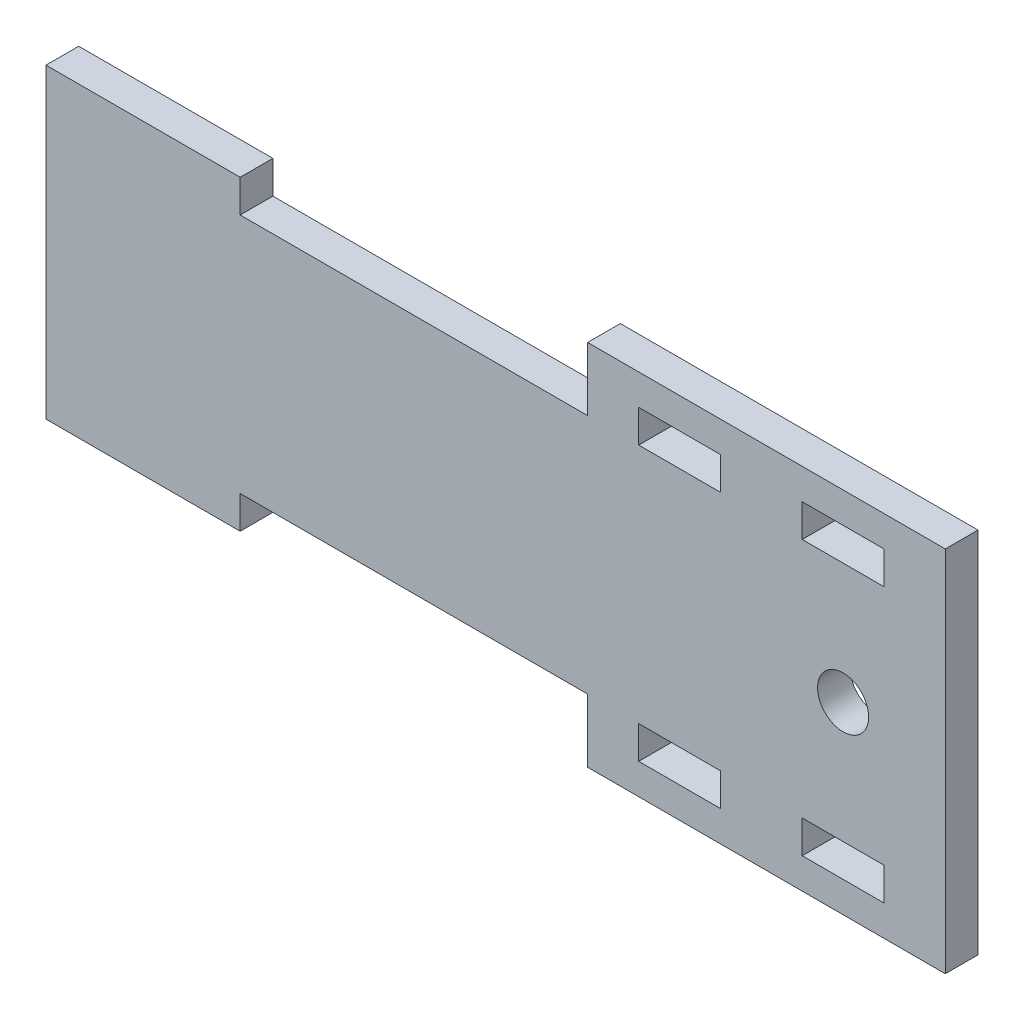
ISO-10303-21;
HEADER;
FILE_DESCRIPTION(('STEP AP214'),'2;1');
FILE_NAME('part.step','',(''),(''),'','','');
FILE_SCHEMA(('AUTOMOTIVE_DESIGN { 1 0 10303 214 1 1 1 1 }'));
ENDSEC;
DATA;
#1=APPLICATION_CONTEXT('core data for automotive mechanical design processes');
#2=APPLICATION_PROTOCOL_DEFINITION('international standard','automotive_design',2000,#1);
#3=PRODUCT_CONTEXT('',#1,'mechanical');
#4=PRODUCT('Part','Part','',(#3));
#5=PRODUCT_RELATED_PRODUCT_CATEGORY('part','',(#4));
#6=PRODUCT_DEFINITION_FORMATION('','',#4);
#7=PRODUCT_DEFINITION_CONTEXT('part definition',#1,'design');
#8=PRODUCT_DEFINITION('design','',#6,#7);
#9=PRODUCT_DEFINITION_SHAPE('','',#8);
#10=(LENGTH_UNIT() NAMED_UNIT(*) SI_UNIT(.MILLI.,.METRE.));
#11=(NAMED_UNIT(*) PLANE_ANGLE_UNIT() SI_UNIT($,.RADIAN.));
#12=(NAMED_UNIT(*) SI_UNIT($,.STERADIAN.) SOLID_ANGLE_UNIT());
#13=UNCERTAINTY_MEASURE_WITH_UNIT(LENGTH_MEASURE(1.E-05),#10,'distance_accuracy_value','');
#14=(GEOMETRIC_REPRESENTATION_CONTEXT(3) GLOBAL_UNCERTAINTY_ASSIGNED_CONTEXT((#13)) GLOBAL_UNIT_ASSIGNED_CONTEXT((#10,
#11,#12)) REPRESENTATION_CONTEXT('',''));
#15=CARTESIAN_POINT('',(0.,0.,0.));
#16=DIRECTION('',(0.,0.,1.));
#17=DIRECTION('',(1.,0.,0.));
#18=AXIS2_PLACEMENT_3D('',#15,#16,#17);
#19=CARTESIAN_POINT('',(0.,0.,3.2));
#20=DIRECTION('',(0.,0.,1.));
#21=DIRECTION('',(1.,0.,0.));
#22=AXIS2_PLACEMENT_3D('',#19,#20,#21);
#23=PLANE('',#22);
#24=DIRECTION('',(0.,-1.,0.));
#25=VECTOR('',#24,1.);
#26=CARTESIAN_POINT('',(-25.,18.,3.2));
#27=LINE('',#26,#25);
#28=CARTESIAN_POINT('',(-25.,18.,3.2));
#29=VERTEX_POINT('',#28);
#30=CARTESIAN_POINT('',(-25.,12.,3.2));
#31=VERTEX_POINT('',#30);
#32=EDGE_CURVE('E369',#29,#31,#27,.T.);
#33=ORIENTED_EDGE('',*,*,#32,.T.);
#34=DIRECTION('',(-0.0221284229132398,-0.999755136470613,0.));
#35=VECTOR('',#34,1.);
#36=CARTESIAN_POINT('',(-25.0044267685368,11.8,3.2));
#37=LINE('',#36,#35);
#38=CARTESIAN_POINT('',(-25.0044267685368,11.8,3.2));
#39=VERTEX_POINT('',#38);
#40=EDGE_CURVE('E372',#31,#39,#37,.T.);
#41=ORIENTED_EDGE('',*,*,#40,.T.);
#42=DIRECTION('',(-1.,0.,0.));
#43=VECTOR('',#42,1.);
#44=CARTESIAN_POINT('',(-58.9971427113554,11.8,3.2));
#45=LINE('',#44,#43);
#46=CARTESIAN_POINT('',(-58.9971427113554,11.8,3.2));
#47=VERTEX_POINT('',#46);
#48=EDGE_CURVE('E375',#39,#47,#45,.T.);
#49=ORIENTED_EDGE('',*,*,#48,.T.);
#50=DIRECTION('',(0.,1.,0.));
#51=VECTOR('',#50,1.);
#52=CARTESIAN_POINT('',(-58.9971427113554,11.8,3.2));
#53=LINE('',#52,#51);
#54=CARTESIAN_POINT('',(-58.9971427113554,15.,3.2));
#55=VERTEX_POINT('',#54);
#56=EDGE_CURVE('E377',#47,#55,#53,.T.);
#57=ORIENTED_EDGE('',*,*,#56,.T.);
#58=DIRECTION('',(-1.,0.,0.));
#59=VECTOR('',#58,1.);
#60=CARTESIAN_POINT('',(-58.9971427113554,15.,3.2));
#61=LINE('',#60,#59);
#62=CARTESIAN_POINT('',(-77.9971427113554,15.,3.2));
#63=VERTEX_POINT('',#62);
#64=EDGE_CURVE('E379',#55,#63,#61,.T.);
#65=ORIENTED_EDGE('',*,*,#64,.T.);
#66=DIRECTION('',(0.,-1.,0.));
#67=VECTOR('',#66,1.);
#68=CARTESIAN_POINT('',(-77.9971427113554,15.,3.2));
#69=LINE('',#68,#67);
#70=CARTESIAN_POINT('',(-77.9971427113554,-14.9999999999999,3.2));
#71=VERTEX_POINT('',#70);
#72=EDGE_CURVE('E381',#63,#71,#69,.T.);
#73=ORIENTED_EDGE('',*,*,#72,.T.);
#74=DIRECTION('',(1.,0.,0.));
#75=VECTOR('',#74,1.);
#76=CARTESIAN_POINT('',(-77.9971427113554,-14.9999999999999,3.2));
#77=LINE('',#76,#75);
#78=CARTESIAN_POINT('',(-58.9971427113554,-14.9999999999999,3.2));
#79=VERTEX_POINT('',#78);
#80=EDGE_CURVE('E383',#71,#79,#77,.T.);
#81=ORIENTED_EDGE('',*,*,#80,.T.);
#82=DIRECTION('',(0.,1.,0.));
#83=VECTOR('',#82,1.);
#84=CARTESIAN_POINT('',(-58.9971427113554,-14.9999999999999,3.2));
#85=LINE('',#84,#83);
#86=CARTESIAN_POINT('',(-58.9971427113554,-11.7999999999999,3.2));
#87=VERTEX_POINT('',#86);
#88=EDGE_CURVE('E385',#79,#87,#85,.T.);
#89=ORIENTED_EDGE('',*,*,#88,.T.);
#90=DIRECTION('',(1.,0.,0.));
#91=VECTOR('',#90,1.);
#92=CARTESIAN_POINT('',(-58.9971427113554,-11.7999999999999,3.2));
#93=LINE('',#92,#91);
#94=CARTESIAN_POINT('',(-25.0044267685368,-11.8,3.2));
#95=VERTEX_POINT('',#94);
#96=EDGE_CURVE('E387',#87,#95,#93,.T.);
#97=ORIENTED_EDGE('',*,*,#96,.T.);
#98=DIRECTION('',(0.0221284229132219,-0.999755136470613,0.));
#99=VECTOR('',#98,1.);
#100=CARTESIAN_POINT('',(-25.0044267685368,-11.8,3.2));
#101=LINE('',#100,#99);
#102=CARTESIAN_POINT('',(-25.,-12.,3.2));
#103=VERTEX_POINT('',#102);
#104=EDGE_CURVE('E389',#95,#103,#101,.T.);
#105=ORIENTED_EDGE('',*,*,#104,.T.);
#106=DIRECTION('',(0.,-1.,0.));
#107=VECTOR('',#106,1.);
#108=CARTESIAN_POINT('',(-25.,-12.,3.2));
#109=LINE('',#108,#107);
#110=CARTESIAN_POINT('',(-25.,-18.,3.2));
#111=VERTEX_POINT('',#110);
#112=EDGE_CURVE('E391',#103,#111,#109,.T.);
#113=ORIENTED_EDGE('',*,*,#112,.T.);
#114=DIRECTION('',(1.,0.,0.));
#115=VECTOR('',#114,1.);
#116=CARTESIAN_POINT('',(-25.,-18.,3.2));
#117=LINE('',#116,#115);
#118=CARTESIAN_POINT('',(10.,-18.,3.2));
#119=VERTEX_POINT('',#118);
#120=EDGE_CURVE('E393',#111,#119,#117,.T.);
#121=ORIENTED_EDGE('',*,*,#120,.T.);
#122=DIRECTION('',(0.,1.,0.));
#123=VECTOR('',#122,1.);
#124=CARTESIAN_POINT('',(10.,18.,3.2));
#125=LINE('',#124,#123);
#126=CARTESIAN_POINT('',(10.,18.,3.2));
#127=VERTEX_POINT('',#126);
#128=EDGE_CURVE('E395',#119,#127,#125,.T.);
#129=ORIENTED_EDGE('',*,*,#128,.T.);
#130=DIRECTION('',(-1.,0.,0.));
#131=VECTOR('',#130,1.);
#132=CARTESIAN_POINT('',(-25.,18.,3.2));
#133=LINE('',#132,#131);
#134=EDGE_CURVE('E397',#127,#29,#133,.T.);
#135=ORIENTED_EDGE('',*,*,#134,.T.);
#136=EDGE_LOOP('',(#33,#41,#49,#57,#65,#73,#81,#89,#97,#105,#113,#121,#129,#135));
#137=FACE_BOUND('',#136,.T.);
#138=CARTESIAN_POINT('',(0.,0.,3.2));
#139=DIRECTION('',(0.,0.,1.));
#140=DIRECTION('',(1.,0.,0.));
#141=AXIS2_PLACEMENT_3D('',#138,#139,#140);
#142=CIRCLE('',#141,2.5);
#143=CARTESIAN_POINT('',(2.5,0.,3.2));
#144=VERTEX_POINT('',#143);
#145=EDGE_CURVE('E363',#144,#144,#142,.T.);
#146=ORIENTED_EDGE('',*,*,#145,.F.);
#147=EDGE_LOOP('',(#146));
#148=FACE_BOUND('',#147,.T.);
#149=DIRECTION('',(-1.,0.,0.));
#150=VECTOR('',#149,1.);
#151=CARTESIAN_POINT('',(4.,-11.8,3.2));
#152=LINE('',#151,#150);
#153=CARTESIAN_POINT('',(4.,-11.8,3.2));
#154=VERTEX_POINT('',#153);
#155=CARTESIAN_POINT('',(-4.,-11.8,3.2));
#156=VERTEX_POINT('',#155);
#157=EDGE_CURVE('E334',#154,#156,#152,.T.);
#158=ORIENTED_EDGE('',*,*,#157,.F.);
#159=DIRECTION('',(0.,1.,0.));
#160=VECTOR('',#159,1.);
#161=CARTESIAN_POINT('',(4.,-15.,3.2));
#162=LINE('',#161,#160);
#163=CARTESIAN_POINT('',(4.,-15.,3.2));
#164=VERTEX_POINT('',#163);
#165=EDGE_CURVE('E332',#164,#154,#162,.T.);
#166=ORIENTED_EDGE('',*,*,#165,.F.);
#167=DIRECTION('',(1.,0.,0.));
#168=VECTOR('',#167,1.);
#169=CARTESIAN_POINT('',(4.,-15.,3.2));
#170=LINE('',#169,#168);
#171=CARTESIAN_POINT('',(-4.,-15.,3.2));
#172=VERTEX_POINT('',#171);
#173=EDGE_CURVE('E340',#172,#164,#170,.T.);
#174=ORIENTED_EDGE('',*,*,#173,.F.);
#175=DIRECTION('',(0.,-1.,0.));
#176=VECTOR('',#175,1.);
#177=CARTESIAN_POINT('',(-4.,-15.,3.2));
#178=LINE('',#177,#176);
#179=EDGE_CURVE('E337',#156,#172,#178,.T.);
#180=ORIENTED_EDGE('',*,*,#179,.F.);
#181=EDGE_LOOP('',(#158,#166,#174,#180));
#182=FACE_BOUND('',#181,.T.);
#183=DIRECTION('',(-1.,0.,0.));
#184=VECTOR('',#183,1.);
#185=CARTESIAN_POINT('',(-12.,-11.8,3.2));
#186=LINE('',#185,#184);
#187=CARTESIAN_POINT('',(-12.,-11.8,3.2));
#188=VERTEX_POINT('',#187);
#189=CARTESIAN_POINT('',(-20.,-11.8,3.2));
#190=VERTEX_POINT('',#189);
#191=EDGE_CURVE('E303',#188,#190,#186,.T.);
#192=ORIENTED_EDGE('',*,*,#191,.F.);
#193=DIRECTION('',(0.,1.,0.));
#194=VECTOR('',#193,1.);
#195=CARTESIAN_POINT('',(-12.,-11.8,3.2));
#196=LINE('',#195,#194);
#197=CARTESIAN_POINT('',(-12.,-15.,3.2));
#198=VERTEX_POINT('',#197);
#199=EDGE_CURVE('E301',#198,#188,#196,.T.);
#200=ORIENTED_EDGE('',*,*,#199,.F.);
#201=DIRECTION('',(1.,0.,0.));
#202=VECTOR('',#201,1.);
#203=CARTESIAN_POINT('',(-12.,-15.,3.2));
#204=LINE('',#203,#202);
#205=CARTESIAN_POINT('',(-20.,-15.,3.2));
#206=VERTEX_POINT('',#205);
#207=EDGE_CURVE('E309',#206,#198,#204,.T.);
#208=ORIENTED_EDGE('',*,*,#207,.F.);
#209=DIRECTION('',(0.,-1.,0.));
#210=VECTOR('',#209,1.);
#211=CARTESIAN_POINT('',(-20.,-11.8,3.2));
#212=LINE('',#211,#210);
#213=EDGE_CURVE('E306',#190,#206,#212,.T.);
#214=ORIENTED_EDGE('',*,*,#213,.F.);
#215=EDGE_LOOP('',(#192,#200,#208,#214));
#216=FACE_BOUND('',#215,.T.);
#217=DIRECTION('',(-1.,0.,0.));
#218=VECTOR('',#217,1.);
#219=CARTESIAN_POINT('',(4.,15.,3.2));
#220=LINE('',#219,#218);
#221=CARTESIAN_POINT('',(4.,15.,3.2));
#222=VERTEX_POINT('',#221);
#223=CARTESIAN_POINT('',(-4.,15.,3.2));
#224=VERTEX_POINT('',#223);
#225=EDGE_CURVE('E272',#222,#224,#220,.T.);
#226=ORIENTED_EDGE('',*,*,#225,.F.);
#227=DIRECTION('',(0.,1.,0.));
#228=VECTOR('',#227,1.);
#229=CARTESIAN_POINT('',(4.,15.,3.2));
#230=LINE('',#229,#228);
#231=CARTESIAN_POINT('',(4.,11.8,3.2));
#232=VERTEX_POINT('',#231);
#233=EDGE_CURVE('E270',#232,#222,#230,.T.);
#234=ORIENTED_EDGE('',*,*,#233,.F.);
#235=DIRECTION('',(1.,0.,0.));
#236=VECTOR('',#235,1.);
#237=CARTESIAN_POINT('',(4.,11.8,3.2));
#238=LINE('',#237,#236);
#239=CARTESIAN_POINT('',(-4.,11.8,3.2));
#240=VERTEX_POINT('',#239);
#241=EDGE_CURVE('E278',#240,#232,#238,.T.);
#242=ORIENTED_EDGE('',*,*,#241,.F.);
#243=DIRECTION('',(0.,-1.,0.));
#244=VECTOR('',#243,1.);
#245=CARTESIAN_POINT('',(-4.,15.,3.2));
#246=LINE('',#245,#244);
#247=EDGE_CURVE('E275',#224,#240,#246,.T.);
#248=ORIENTED_EDGE('',*,*,#247,.F.);
#249=EDGE_LOOP('',(#226,#234,#242,#248));
#250=FACE_BOUND('',#249,.T.);
#251=DIRECTION('',(-1.,0.,0.));
#252=VECTOR('',#251,1.);
#253=CARTESIAN_POINT('',(-12.,15.,3.2));
#254=LINE('',#253,#252);
#255=CARTESIAN_POINT('',(-12.,15.,3.2));
#256=VERTEX_POINT('',#255);
#257=CARTESIAN_POINT('',(-20.,15.,3.2));
#258=VERTEX_POINT('',#257);
#259=EDGE_CURVE('E242',#256,#258,#254,.T.);
#260=ORIENTED_EDGE('',*,*,#259,.F.);
#261=DIRECTION('',(0.,1.,0.));
#262=VECTOR('',#261,1.);
#263=CARTESIAN_POINT('',(-12.,11.8,3.2));
#264=LINE('',#263,#262);
#265=CARTESIAN_POINT('',(-12.,11.8,3.2));
#266=VERTEX_POINT('',#265);
#267=EDGE_CURVE('E234',#266,#256,#264,.T.);
#268=ORIENTED_EDGE('',*,*,#267,.F.);
#269=DIRECTION('',(1.,0.,0.));
#270=VECTOR('',#269,1.);
#271=CARTESIAN_POINT('',(-12.,11.8,3.2));
#272=LINE('',#271,#270);
#273=CARTESIAN_POINT('',(-20.,11.8,3.2));
#274=VERTEX_POINT('',#273);
#275=EDGE_CURVE('E256',#274,#266,#272,.T.);
#276=ORIENTED_EDGE('',*,*,#275,.F.);
#277=DIRECTION('',(0.,-1.,0.));
#278=VECTOR('',#277,1.);
#279=CARTESIAN_POINT('',(-20.,11.8,3.2));
#280=LINE('',#279,#278);
#281=EDGE_CURVE('E254',#258,#274,#280,.T.);
#282=ORIENTED_EDGE('',*,*,#281,.F.);
#283=EDGE_LOOP('',(#260,#268,#276,#282));
#284=FACE_BOUND('',#283,.T.);
#285=ADVANCED_FACE('F37',(#137,#148,#182,#216,#250,#284),#23,.T.);
#286=CARTESIAN_POINT('',(0.,0.,0.));
#287=DIRECTION('',(0.,0.,1.));
#288=DIRECTION('',(1.,0.,0.));
#289=AXIS2_PLACEMENT_3D('',#286,#287,#288);
#290=PLANE('',#289);
#291=DIRECTION('',(0.,1.,0.));
#292=VECTOR('',#291,1.);
#293=CARTESIAN_POINT('',(4.,15.,0.));
#294=LINE('',#293,#292);
#295=CARTESIAN_POINT('',(4.,11.8,0.));
#296=VERTEX_POINT('',#295);
#297=CARTESIAN_POINT('',(4.,15.,0.));
#298=VERTEX_POINT('',#297);
#299=EDGE_CURVE('E250',#296,#298,#294,.T.);
#300=ORIENTED_EDGE('',*,*,#299,.T.);
#301=DIRECTION('',(-1.,0.,0.));
#302=VECTOR('',#301,1.);
#303=CARTESIAN_POINT('',(4.,15.,0.));
#304=LINE('',#303,#302);
#305=CARTESIAN_POINT('',(-4.,15.,0.));
#306=VERTEX_POINT('',#305);
#307=EDGE_CURVE('E283',#298,#306,#304,.T.);
#308=ORIENTED_EDGE('',*,*,#307,.T.);
#309=DIRECTION('',(0.,-1.,0.));
#310=VECTOR('',#309,1.);
#311=CARTESIAN_POINT('',(-4.,15.,0.));
#312=LINE('',#311,#310);
#313=CARTESIAN_POINT('',(-4.,11.8,0.));
#314=VERTEX_POINT('',#313);
#315=EDGE_CURVE('E286',#306,#314,#312,.T.);
#316=ORIENTED_EDGE('',*,*,#315,.T.);
#317=DIRECTION('',(1.,0.,0.));
#318=VECTOR('',#317,1.);
#319=CARTESIAN_POINT('',(4.,11.8,0.));
#320=LINE('',#319,#318);
#321=EDGE_CURVE('E273',#314,#296,#320,.T.);
#322=ORIENTED_EDGE('',*,*,#321,.T.);
#323=EDGE_LOOP('',(#300,#308,#316,#322));
#324=FACE_BOUND('',#323,.T.);
#325=DIRECTION('',(0.,1.,0.));
#326=VECTOR('',#325,1.);
#327=CARTESIAN_POINT('',(4.,-15.,0.));
#328=LINE('',#327,#326);
#329=CARTESIAN_POINT('',(4.,-15.,0.));
#330=VERTEX_POINT('',#329);
#331=CARTESIAN_POINT('',(4.,-11.8,0.));
#332=VERTEX_POINT('',#331);
#333=EDGE_CURVE('E331',#330,#332,#328,.T.);
#334=ORIENTED_EDGE('',*,*,#333,.T.);
#335=DIRECTION('',(-1.,0.,0.));
#336=VECTOR('',#335,1.);
#337=CARTESIAN_POINT('',(4.,-11.8,0.));
#338=LINE('',#337,#336);
#339=CARTESIAN_POINT('',(-4.,-11.8,0.));
#340=VERTEX_POINT('',#339);
#341=EDGE_CURVE('E345',#332,#340,#338,.T.);
#342=ORIENTED_EDGE('',*,*,#341,.T.);
#343=DIRECTION('',(0.,-1.,0.));
#344=VECTOR('',#343,1.);
#345=CARTESIAN_POINT('',(-4.,-15.,0.));
#346=LINE('',#345,#344);
#347=CARTESIAN_POINT('',(-4.,-15.,0.));
#348=VERTEX_POINT('',#347);
#349=EDGE_CURVE('E348',#340,#348,#346,.T.);
#350=ORIENTED_EDGE('',*,*,#349,.T.);
#351=DIRECTION('',(1.,0.,0.));
#352=VECTOR('',#351,1.);
#353=CARTESIAN_POINT('',(4.,-15.,0.));
#354=LINE('',#353,#352);
#355=EDGE_CURVE('E335',#348,#330,#354,.T.);
#356=ORIENTED_EDGE('',*,*,#355,.T.);
#357=EDGE_LOOP('',(#334,#342,#350,#356));
#358=FACE_BOUND('',#357,.T.);
#359=DIRECTION('',(0.,-1.,0.));
#360=VECTOR('',#359,1.);
#361=CARTESIAN_POINT('',(-25.,18.,0.));
#362=LINE('',#361,#360);
#363=CARTESIAN_POINT('',(-25.,18.,0.));
#364=VERTEX_POINT('',#363);
#365=CARTESIAN_POINT('',(-25.,12.,0.));
#366=VERTEX_POINT('',#365);
#367=EDGE_CURVE('E366',#364,#366,#362,.T.);
#368=ORIENTED_EDGE('',*,*,#367,.F.);
#369=DIRECTION('',(-1.,0.,0.));
#370=VECTOR('',#369,1.);
#371=CARTESIAN_POINT('',(-25.,18.,0.));
#372=LINE('',#371,#370);
#373=CARTESIAN_POINT('',(10.,18.,0.));
#374=VERTEX_POINT('',#373);
#375=EDGE_CURVE('E373',#374,#364,#372,.T.);
#376=ORIENTED_EDGE('',*,*,#375,.F.);
#377=DIRECTION('',(0.,1.,0.));
#378=VECTOR('',#377,1.);
#379=CARTESIAN_POINT('',(10.,18.,0.));
#380=LINE('',#379,#378);
#381=CARTESIAN_POINT('',(10.,-18.,0.));
#382=VERTEX_POINT('',#381);
#383=EDGE_CURVE('E425',#382,#374,#380,.T.);
#384=ORIENTED_EDGE('',*,*,#383,.F.);
#385=DIRECTION('',(1.,0.,0.));
#386=VECTOR('',#385,1.);
#387=CARTESIAN_POINT('',(-25.,-18.,0.));
#388=LINE('',#387,#386);
#389=CARTESIAN_POINT('',(-25.,-18.,0.));
#390=VERTEX_POINT('',#389);
#391=EDGE_CURVE('E423',#390,#382,#388,.T.);
#392=ORIENTED_EDGE('',*,*,#391,.F.);
#393=DIRECTION('',(0.,-1.,0.));
#394=VECTOR('',#393,1.);
#395=CARTESIAN_POINT('',(-25.,-12.,0.));
#396=LINE('',#395,#394);
#397=CARTESIAN_POINT('',(-25.,-12.,0.));
#398=VERTEX_POINT('',#397);
#399=EDGE_CURVE('E421',#398,#390,#396,.T.);
#400=ORIENTED_EDGE('',*,*,#399,.F.);
#401=DIRECTION('',(0.0221284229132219,-0.999755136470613,0.));
#402=VECTOR('',#401,1.);
#403=CARTESIAN_POINT('',(-25.0044267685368,-11.8,0.));
#404=LINE('',#403,#402);
#405=CARTESIAN_POINT('',(-25.0044267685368,-11.8,0.));
#406=VERTEX_POINT('',#405);
#407=EDGE_CURVE('E419',#406,#398,#404,.T.);
#408=ORIENTED_EDGE('',*,*,#407,.F.);
#409=DIRECTION('',(1.,0.,0.));
#410=VECTOR('',#409,1.);
#411=CARTESIAN_POINT('',(-58.9971427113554,-11.7999999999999,0.));
#412=LINE('',#411,#410);
#413=CARTESIAN_POINT('',(-58.9971427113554,-11.7999999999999,0.));
#414=VERTEX_POINT('',#413);
#415=EDGE_CURVE('E417',#414,#406,#412,.T.);
#416=ORIENTED_EDGE('',*,*,#415,.F.);
#417=DIRECTION('',(0.,1.,0.));
#418=VECTOR('',#417,1.);
#419=CARTESIAN_POINT('',(-58.9971427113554,-14.9999999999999,0.));
#420=LINE('',#419,#418);
#421=CARTESIAN_POINT('',(-58.9971427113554,-14.9999999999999,0.));
#422=VERTEX_POINT('',#421);
#423=EDGE_CURVE('E415',#422,#414,#420,.T.);
#424=ORIENTED_EDGE('',*,*,#423,.F.);
#425=DIRECTION('',(1.,0.,0.));
#426=VECTOR('',#425,1.);
#427=CARTESIAN_POINT('',(-77.9971427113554,-14.9999999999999,0.));
#428=LINE('',#427,#426);
#429=CARTESIAN_POINT('',(-77.9971427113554,-14.9999999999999,0.));
#430=VERTEX_POINT('',#429);
#431=EDGE_CURVE('E413',#430,#422,#428,.T.);
#432=ORIENTED_EDGE('',*,*,#431,.F.);
#433=DIRECTION('',(0.,-1.,0.));
#434=VECTOR('',#433,1.);
#435=CARTESIAN_POINT('',(-77.9971427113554,11.8,0.));
#436=LINE('',#435,#434);
#437=CARTESIAN_POINT('',(-77.9971427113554,15.,0.));
#438=VERTEX_POINT('',#437);
#439=EDGE_CURVE('E411',#438,#430,#436,.T.);
#440=ORIENTED_EDGE('',*,*,#439,.F.);
#441=DIRECTION('',(-1.,0.,0.));
#442=VECTOR('',#441,1.);
#443=CARTESIAN_POINT('',(-58.9971427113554,15.,0.));
#444=LINE('',#443,#442);
#445=CARTESIAN_POINT('',(-58.9971427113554,15.,0.));
#446=VERTEX_POINT('',#445);
#447=EDGE_CURVE('E408',#446,#438,#444,.T.);
#448=ORIENTED_EDGE('',*,*,#447,.F.);
#449=DIRECTION('',(0.,1.,0.));
#450=VECTOR('',#449,1.);
#451=CARTESIAN_POINT('',(-58.9971427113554,11.8,0.));
#452=LINE('',#451,#450);
#453=CARTESIAN_POINT('',(-58.9971427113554,11.8,0.));
#454=VERTEX_POINT('',#453);
#455=EDGE_CURVE('E406',#454,#446,#452,.T.);
#456=ORIENTED_EDGE('',*,*,#455,.F.);
#457=DIRECTION('',(-1.,0.,0.));
#458=VECTOR('',#457,1.);
#459=CARTESIAN_POINT('',(-58.9971427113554,11.8,0.));
#460=LINE('',#459,#458);
#461=CARTESIAN_POINT('',(-25.0044267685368,11.8,0.));
#462=VERTEX_POINT('',#461);
#463=EDGE_CURVE('E404',#462,#454,#460,.T.);
#464=ORIENTED_EDGE('',*,*,#463,.F.);
#465=DIRECTION('',(-0.0221284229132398,-0.999755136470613,0.));
#466=VECTOR('',#465,1.);
#467=CARTESIAN_POINT('',(-25.0044267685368,11.8,0.));
#468=LINE('',#467,#466);
#469=EDGE_CURVE('E402',#366,#462,#468,.T.);
#470=ORIENTED_EDGE('',*,*,#469,.F.);
#471=EDGE_LOOP('',(#368,#376,#384,#392,#400,#408,#416,#424,#432,#440,#448,#456,#464,#470));
#472=FACE_BOUND('',#471,.T.);
#473=CARTESIAN_POINT('',(0.,0.,0.));
#474=DIRECTION('',(0.,0.,1.));
#475=DIRECTION('',(1.,0.,0.));
#476=AXIS2_PLACEMENT_3D('',#473,#474,#475);
#477=CIRCLE('',#476,2.5);
#478=CARTESIAN_POINT('',(2.5,0.,0.));
#479=VERTEX_POINT('',#478);
#480=EDGE_CURVE('E362',#479,#479,#477,.T.);
#481=ORIENTED_EDGE('',*,*,#480,.T.);
#482=EDGE_LOOP('',(#481));
#483=FACE_BOUND('',#482,.T.);
#484=DIRECTION('',(0.,1.,0.));
#485=VECTOR('',#484,1.);
#486=CARTESIAN_POINT('',(-12.,-11.8,0.));
#487=LINE('',#486,#485);
#488=CARTESIAN_POINT('',(-12.,-15.,0.));
#489=VERTEX_POINT('',#488);
#490=CARTESIAN_POINT('',(-12.,-11.8,0.));
#491=VERTEX_POINT('',#490);
#492=EDGE_CURVE('E300',#489,#491,#487,.T.);
#493=ORIENTED_EDGE('',*,*,#492,.T.);
#494=DIRECTION('',(-1.,0.,0.));
#495=VECTOR('',#494,1.);
#496=CARTESIAN_POINT('',(-12.,-11.8,0.));
#497=LINE('',#496,#495);
#498=CARTESIAN_POINT('',(-20.,-11.8,0.));
#499=VERTEX_POINT('',#498);
#500=EDGE_CURVE('E314',#491,#499,#497,.T.);
#501=ORIENTED_EDGE('',*,*,#500,.T.);
#502=DIRECTION('',(0.,-1.,0.));
#503=VECTOR('',#502,1.);
#504=CARTESIAN_POINT('',(-20.,-11.8,0.));
#505=LINE('',#504,#503);
#506=CARTESIAN_POINT('',(-20.,-15.,0.));
#507=VERTEX_POINT('',#506);
#508=EDGE_CURVE('E317',#499,#507,#505,.T.);
#509=ORIENTED_EDGE('',*,*,#508,.T.);
#510=DIRECTION('',(1.,0.,0.));
#511=VECTOR('',#510,1.);
#512=CARTESIAN_POINT('',(-12.,-15.,0.));
#513=LINE('',#512,#511);
#514=EDGE_CURVE('E304',#507,#489,#513,.T.);
#515=ORIENTED_EDGE('',*,*,#514,.T.);
#516=EDGE_LOOP('',(#493,#501,#509,#515));
#517=FACE_BOUND('',#516,.T.);
#518=DIRECTION('',(0.,1.,0.));
#519=VECTOR('',#518,1.);
#520=CARTESIAN_POINT('',(-12.,11.8,0.));
#521=LINE('',#520,#519);
#522=CARTESIAN_POINT('',(-12.,11.8,0.));
#523=VERTEX_POINT('',#522);
#524=CARTESIAN_POINT('',(-12.,15.,0.));
#525=VERTEX_POINT('',#524);
#526=EDGE_CURVE('E60',#523,#525,#521,.T.);
#527=ORIENTED_EDGE('',*,*,#526,.T.);
#528=DIRECTION('',(-1.,0.,0.));
#529=VECTOR('',#528,1.);
#530=CARTESIAN_POINT('',(-12.,15.,0.));
#531=LINE('',#530,#529);
#532=CARTESIAN_POINT('',(-20.,15.,0.));
#533=VERTEX_POINT('',#532);
#534=EDGE_CURVE('E249',#525,#533,#531,.T.);
#535=ORIENTED_EDGE('',*,*,#534,.T.);
#536=DIRECTION('',(0.,-1.,0.));
#537=VECTOR('',#536,1.);
#538=CARTESIAN_POINT('',(-20.,11.8,0.));
#539=LINE('',#538,#537);
#540=CARTESIAN_POINT('',(-20.,11.8,0.));
#541=VERTEX_POINT('',#540);
#542=EDGE_CURVE('E262',#533,#541,#539,.T.);
#543=ORIENTED_EDGE('',*,*,#542,.T.);
#544=DIRECTION('',(1.,0.,0.));
#545=VECTOR('',#544,1.);
#546=CARTESIAN_POINT('',(-12.,11.8,0.));
#547=LINE('',#546,#545);
#548=EDGE_CURVE('E243',#541,#523,#547,.T.);
#549=ORIENTED_EDGE('',*,*,#548,.T.);
#550=EDGE_LOOP('',(#527,#535,#543,#549));
#551=FACE_BOUND('',#550,.T.);
#552=ADVANCED_FACE('F473',(#324,#358,#472,#483,#517,#551),#290,.F.);
#553=CARTESIAN_POINT('',(-25.,18.,3.2));
#554=DIRECTION('',(1.,0.,0.));
#555=DIRECTION('',(0.,0.,-1.));
#556=AXIS2_PLACEMENT_3D('',#553,#554,#555);
#557=PLANE('',#556);
#558=ORIENTED_EDGE('',*,*,#367,.T.);
#559=DIRECTION('',(0.,0.,-1.));
#560=VECTOR('',#559,1.);
#561=CARTESIAN_POINT('',(-25.,12.,3.2));
#562=LINE('',#561,#560);
#563=EDGE_CURVE('E11',#31,#366,#562,.T.);
#564=ORIENTED_EDGE('',*,*,#563,.F.);
#565=ORIENTED_EDGE('',*,*,#32,.F.);
#566=DIRECTION('',(0.,0.,-1.));
#567=VECTOR('',#566,1.);
#568=CARTESIAN_POINT('',(-25.,18.,3.2));
#569=LINE('',#568,#567);
#570=EDGE_CURVE('E399',#29,#364,#569,.T.);
#571=ORIENTED_EDGE('',*,*,#570,.T.);
#572=EDGE_LOOP('',(#558,#564,#565,#571));
#573=FACE_BOUND('',#572,.T.);
#574=ADVANCED_FACE('F39',(#573),#557,.F.);
#575=CARTESIAN_POINT('',(-25.0044267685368,11.8,3.2));
#576=DIRECTION('',(0.999755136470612,-0.0221284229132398,0.));
#577=DIRECTION('',(0.0221284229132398,0.999755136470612,0.));
#578=AXIS2_PLACEMENT_3D('',#575,#576,#577);
#579=PLANE('',#578);
#580=ORIENTED_EDGE('',*,*,#469,.T.);
#581=DIRECTION('',(0.,0.,-1.));
#582=VECTOR('',#581,1.);
#583=CARTESIAN_POINT('',(-25.0044267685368,11.8,3.2));
#584=LINE('',#583,#582);
#585=EDGE_CURVE('E45',#39,#462,#584,.T.);
#586=ORIENTED_EDGE('',*,*,#585,.F.);
#587=ORIENTED_EDGE('',*,*,#40,.F.);
#588=ORIENTED_EDGE('',*,*,#563,.T.);
#589=EDGE_LOOP('',(#580,#586,#587,#588));
#590=FACE_BOUND('',#589,.T.);
#591=ADVANCED_FACE('F490',(#590),#579,.F.);
#592=CARTESIAN_POINT('',(-58.9971427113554,11.8,3.2));
#593=DIRECTION('',(0.,-1.,0.));
#594=DIRECTION('',(1.,0.,0.));
#595=AXIS2_PLACEMENT_3D('',#592,#593,#594);
#596=PLANE('',#595);
#597=ORIENTED_EDGE('',*,*,#463,.T.);
#598=DIRECTION('',(0.,0.,-1.));
#599=VECTOR('',#598,1.);
#600=CARTESIAN_POINT('',(-58.9971427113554,11.8,3.2));
#601=LINE('',#600,#599);
#602=EDGE_CURVE('E460',#47,#454,#601,.T.);
#603=ORIENTED_EDGE('',*,*,#602,.F.);
#604=ORIENTED_EDGE('',*,*,#48,.F.);
#605=ORIENTED_EDGE('',*,*,#585,.T.);
#606=EDGE_LOOP('',(#597,#603,#604,#605));
#607=FACE_BOUND('',#606,.T.);
#608=ADVANCED_FACE('F467',(#607),#596,.F.);
#609=CARTESIAN_POINT('',(-58.9971427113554,11.8,3.2));
#610=DIRECTION('',(-1.,0.,0.));
#611=DIRECTION('',(0.,0.,1.));
#612=AXIS2_PLACEMENT_3D('',#609,#610,#611);
#613=PLANE('',#612);
#614=ORIENTED_EDGE('',*,*,#455,.T.);
#615=DIRECTION('',(0.,0.,-1.));
#616=VECTOR('',#615,1.);
#617=CARTESIAN_POINT('',(-58.9971427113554,15.,3.2));
#618=LINE('',#617,#616);
#619=EDGE_CURVE('E457',#55,#446,#618,.T.);
#620=ORIENTED_EDGE('',*,*,#619,.F.);
#621=ORIENTED_EDGE('',*,*,#56,.F.);
#622=ORIENTED_EDGE('',*,*,#602,.T.);
#623=EDGE_LOOP('',(#614,#620,#621,#622));
#624=FACE_BOUND('',#623,.T.);
#625=ADVANCED_FACE('F478',(#624),#613,.F.);
#626=CARTESIAN_POINT('',(-58.9971427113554,15.,3.2));
#627=DIRECTION('',(0.,-1.,0.));
#628=DIRECTION('',(1.,0.,0.));
#629=AXIS2_PLACEMENT_3D('',#626,#627,#628);
#630=PLANE('',#629);
#631=ORIENTED_EDGE('',*,*,#447,.T.);
#632=DIRECTION('',(0.,0.,-1.));
#633=VECTOR('',#632,1.);
#634=CARTESIAN_POINT('',(-77.9971427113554,15.,3.2));
#635=LINE('',#634,#633);
#636=EDGE_CURVE('E454',#63,#438,#635,.T.);
#637=ORIENTED_EDGE('',*,*,#636,.F.);
#638=ORIENTED_EDGE('',*,*,#64,.F.);
#639=ORIENTED_EDGE('',*,*,#619,.T.);
#640=EDGE_LOOP('',(#631,#637,#638,#639));
#641=FACE_BOUND('',#640,.T.);
#642=ADVANCED_FACE('F482',(#641),#630,.F.);
#643=CARTESIAN_POINT('',(-77.9971427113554,11.8,3.2));
#644=DIRECTION('',(1.,0.,0.));
#645=DIRECTION('',(0.,0.,-1.));
#646=AXIS2_PLACEMENT_3D('',#643,#644,#645);
#647=PLANE('',#646);
#648=ORIENTED_EDGE('',*,*,#439,.T.);
#649=DIRECTION('',(0.,0.,-1.));
#650=VECTOR('',#649,1.);
#651=CARTESIAN_POINT('',(-77.9971427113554,-14.9999999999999,3.2));
#652=LINE('',#651,#650);
#653=EDGE_CURVE('E451',#71,#430,#652,.T.);
#654=ORIENTED_EDGE('',*,*,#653,.F.);
#655=ORIENTED_EDGE('',*,*,#72,.F.);
#656=ORIENTED_EDGE('',*,*,#636,.T.);
#657=EDGE_LOOP('',(#648,#654,#655,#656));
#658=FACE_BOUND('',#657,.T.);
#659=ADVANCED_FACE('F533',(#658),#647,.F.);
#660=CARTESIAN_POINT('',(-77.9971427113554,-14.9999999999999,3.2));
#661=DIRECTION('',(0.,1.,0.));
#662=DIRECTION('',(0.,0.,1.));
#663=AXIS2_PLACEMENT_3D('',#660,#661,#662);
#664=PLANE('',#663);
#665=ORIENTED_EDGE('',*,*,#431,.T.);
#666=DIRECTION('',(0.,0.,-1.));
#667=VECTOR('',#666,1.);
#668=CARTESIAN_POINT('',(-58.9971427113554,-14.9999999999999,3.2));
#669=LINE('',#668,#667);
#670=EDGE_CURVE('E448',#79,#422,#669,.T.);
#671=ORIENTED_EDGE('',*,*,#670,.F.);
#672=ORIENTED_EDGE('',*,*,#80,.F.);
#673=ORIENTED_EDGE('',*,*,#653,.T.);
#674=EDGE_LOOP('',(#665,#671,#672,#673));
#675=FACE_BOUND('',#674,.T.);
#676=ADVANCED_FACE('F531',(#675),#664,.F.);
#677=CARTESIAN_POINT('',(-58.9971427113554,-14.9999999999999,3.2));
#678=DIRECTION('',(-1.,0.,0.));
#679=DIRECTION('',(0.,0.,1.));
#680=AXIS2_PLACEMENT_3D('',#677,#678,#679);
#681=PLANE('',#680);
#682=ORIENTED_EDGE('',*,*,#423,.T.);
#683=DIRECTION('',(0.,0.,-1.));
#684=VECTOR('',#683,1.);
#685=CARTESIAN_POINT('',(-58.9971427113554,-11.7999999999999,3.2));
#686=LINE('',#685,#684);
#687=EDGE_CURVE('E445',#87,#414,#686,.T.);
#688=ORIENTED_EDGE('',*,*,#687,.F.);
#689=ORIENTED_EDGE('',*,*,#88,.F.);
#690=ORIENTED_EDGE('',*,*,#670,.T.);
#691=EDGE_LOOP('',(#682,#688,#689,#690));
#692=FACE_BOUND('',#691,.T.);
#693=ADVANCED_FACE('F526',(#692),#681,.F.);
#694=CARTESIAN_POINT('',(-58.9971427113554,-11.7999999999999,3.2));
#695=DIRECTION('',(0.,1.,0.));
#696=DIRECTION('',(-1.,0.,0.));
#697=AXIS2_PLACEMENT_3D('',#694,#695,#696);
#698=PLANE('',#697);
#699=ORIENTED_EDGE('',*,*,#415,.T.);
#700=DIRECTION('',(0.,0.,-1.));
#701=VECTOR('',#700,1.);
#702=CARTESIAN_POINT('',(-25.0044267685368,-11.8,3.2));
#703=LINE('',#702,#701);
#704=EDGE_CURVE('E442',#95,#406,#703,.T.);
#705=ORIENTED_EDGE('',*,*,#704,.F.);
#706=ORIENTED_EDGE('',*,*,#96,.F.);
#707=ORIENTED_EDGE('',*,*,#687,.T.);
#708=EDGE_LOOP('',(#699,#705,#706,#707));
#709=FACE_BOUND('',#708,.T.);
#710=ADVANCED_FACE('F521',(#709),#698,.F.);
#711=CARTESIAN_POINT('',(-25.0044267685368,-11.8,3.2));
#712=DIRECTION('',(0.999755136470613,0.0221284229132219,0.));
#713=DIRECTION('',(-0.0221284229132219,0.999755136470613,0.));
#714=AXIS2_PLACEMENT_3D('',#711,#712,#713);
#715=PLANE('',#714);
#716=ORIENTED_EDGE('',*,*,#407,.T.);
#717=DIRECTION('',(0.,0.,-1.));
#718=VECTOR('',#717,1.);
#719=CARTESIAN_POINT('',(-25.,-12.,3.2));
#720=LINE('',#719,#718);
#721=EDGE_CURVE('E439',#103,#398,#720,.T.);
#722=ORIENTED_EDGE('',*,*,#721,.F.);
#723=ORIENTED_EDGE('',*,*,#104,.F.);
#724=ORIENTED_EDGE('',*,*,#704,.T.);
#725=EDGE_LOOP('',(#716,#722,#723,#724));
#726=FACE_BOUND('',#725,.T.);
#727=ADVANCED_FACE('F517',(#726),#715,.F.);
#728=CARTESIAN_POINT('',(-25.,-12.,3.2));
#729=DIRECTION('',(1.,0.,0.));
#730=DIRECTION('',(0.,0.,-1.));
#731=AXIS2_PLACEMENT_3D('',#728,#729,#730);
#732=PLANE('',#731);
#733=ORIENTED_EDGE('',*,*,#399,.T.);
#734=DIRECTION('',(0.,0.,-1.));
#735=VECTOR('',#734,1.);
#736=CARTESIAN_POINT('',(-25.,-18.,3.2));
#737=LINE('',#736,#735);
#738=EDGE_CURVE('E436',#111,#390,#737,.T.);
#739=ORIENTED_EDGE('',*,*,#738,.F.);
#740=ORIENTED_EDGE('',*,*,#112,.F.);
#741=ORIENTED_EDGE('',*,*,#721,.T.);
#742=EDGE_LOOP('',(#733,#739,#740,#741));
#743=FACE_BOUND('',#742,.T.);
#744=ADVANCED_FACE('F512',(#743),#732,.F.);
#745=CARTESIAN_POINT('',(-25.,-18.,3.2));
#746=DIRECTION('',(0.,1.,0.));
#747=DIRECTION('',(0.,0.,1.));
#748=AXIS2_PLACEMENT_3D('',#745,#746,#747);
#749=PLANE('',#748);
#750=ORIENTED_EDGE('',*,*,#391,.T.);
#751=DIRECTION('',(0.,0.,-1.));
#752=VECTOR('',#751,1.);
#753=CARTESIAN_POINT('',(10.,-18.,3.2));
#754=LINE('',#753,#752);
#755=EDGE_CURVE('E433',#119,#382,#754,.T.);
#756=ORIENTED_EDGE('',*,*,#755,.F.);
#757=ORIENTED_EDGE('',*,*,#120,.F.);
#758=ORIENTED_EDGE('',*,*,#738,.T.);
#759=EDGE_LOOP('',(#750,#756,#757,#758));
#760=FACE_BOUND('',#759,.T.);
#761=ADVANCED_FACE('F506',(#760),#749,.F.);
#762=CARTESIAN_POINT('',(10.,18.,3.2));
#763=DIRECTION('',(-1.,0.,0.));
#764=DIRECTION('',(0.,-1.,0.));
#765=AXIS2_PLACEMENT_3D('',#762,#763,#764);
#766=PLANE('',#765);
#767=ORIENTED_EDGE('',*,*,#383,.T.);
#768=DIRECTION('',(0.,0.,-1.));
#769=VECTOR('',#768,1.);
#770=CARTESIAN_POINT('',(10.,18.,3.2));
#771=LINE('',#770,#769);
#772=EDGE_CURVE('E430',#127,#374,#771,.T.);
#773=ORIENTED_EDGE('',*,*,#772,.F.);
#774=ORIENTED_EDGE('',*,*,#128,.F.);
#775=ORIENTED_EDGE('',*,*,#755,.T.);
#776=EDGE_LOOP('',(#767,#773,#774,#775));
#777=FACE_BOUND('',#776,.T.);
#778=ADVANCED_FACE('F502',(#777),#766,.F.);
#779=CARTESIAN_POINT('',(-25.,18.,3.2));
#780=DIRECTION('',(0.,-1.,0.));
#781=DIRECTION('',(0.,0.,-1.));
#782=AXIS2_PLACEMENT_3D('',#779,#780,#781);
#783=PLANE('',#782);
#784=ORIENTED_EDGE('',*,*,#375,.T.);
#785=ORIENTED_EDGE('',*,*,#570,.F.);
#786=ORIENTED_EDGE('',*,*,#134,.F.);
#787=ORIENTED_EDGE('',*,*,#772,.T.);
#788=EDGE_LOOP('',(#784,#785,#786,#787));
#789=FACE_BOUND('',#788,.T.);
#790=ADVANCED_FACE('F497',(#789),#783,.F.);
#791=CARTESIAN_POINT('',(0.,0.,3.2));
#792=DIRECTION('',(0.,0.,-1.));
#793=DIRECTION('',(-1.,0.,0.));
#794=AXIS2_PLACEMENT_3D('',#791,#792,#793);
#795=CYLINDRICAL_SURFACE('',#794,2.5);
#796=ORIENTED_EDGE('',*,*,#145,.T.);
#797=EDGE_LOOP('',(#796));
#798=FACE_BOUND('',#797,.T.);
#799=ORIENTED_EDGE('',*,*,#480,.F.);
#800=EDGE_LOOP('',(#799));
#801=FACE_BOUND('',#800,.T.);
#802=ADVANCED_FACE('F550',(#798,#801),#795,.F.);
#803=CARTESIAN_POINT('',(4.,-15.,3.2));
#804=DIRECTION('',(-1.,0.,0.));
#805=DIRECTION('',(0.,0.,1.));
#806=AXIS2_PLACEMENT_3D('',#803,#804,#805);
#807=PLANE('',#806);
#808=ORIENTED_EDGE('',*,*,#333,.F.);
#809=DIRECTION('',(0.,0.,-1.));
#810=VECTOR('',#809,1.);
#811=CARTESIAN_POINT('',(4.,-15.,3.2));
#812=LINE('',#811,#810);
#813=EDGE_CURVE('E342',#164,#330,#812,.T.);
#814=ORIENTED_EDGE('',*,*,#813,.F.);
#815=ORIENTED_EDGE('',*,*,#165,.T.);
#816=DIRECTION('',(0.,0.,-1.));
#817=VECTOR('',#816,1.);
#818=CARTESIAN_POINT('',(4.,-11.8,3.2));
#819=LINE('',#818,#817);
#820=EDGE_CURVE('E359',#154,#332,#819,.T.);
#821=ORIENTED_EDGE('',*,*,#820,.T.);
#822=EDGE_LOOP('',(#808,#814,#815,#821));
#823=FACE_BOUND('',#822,.T.);
#824=ADVANCED_FACE('F600',(#823),#807,.T.);
#825=CARTESIAN_POINT('',(4.,-11.8,3.2));
#826=DIRECTION('',(0.,-1.,0.));
#827=DIRECTION('',(0.,0.,-1.));
#828=AXIS2_PLACEMENT_3D('',#825,#826,#827);
#829=PLANE('',#828);
#830=ORIENTED_EDGE('',*,*,#341,.F.);
#831=ORIENTED_EDGE('',*,*,#820,.F.);
#832=ORIENTED_EDGE('',*,*,#157,.T.);
#833=DIRECTION('',(0.,0.,-1.));
#834=VECTOR('',#833,1.);
#835=CARTESIAN_POINT('',(-4.,-11.8,3.2));
#836=LINE('',#835,#834);
#837=EDGE_CURVE('E357',#156,#340,#836,.T.);
#838=ORIENTED_EDGE('',*,*,#837,.T.);
#839=EDGE_LOOP('',(#830,#831,#832,#838));
#840=FACE_BOUND('',#839,.T.);
#841=ADVANCED_FACE('F607',(#840),#829,.T.);
#842=CARTESIAN_POINT('',(-4.,-15.,3.2));
#843=DIRECTION('',(1.,0.,0.));
#844=DIRECTION('',(0.,0.,-1.));
#845=AXIS2_PLACEMENT_3D('',#842,#843,#844);
#846=PLANE('',#845);
#847=ORIENTED_EDGE('',*,*,#349,.F.);
#848=ORIENTED_EDGE('',*,*,#837,.F.);
#849=ORIENTED_EDGE('',*,*,#179,.T.);
#850=DIRECTION('',(0.,0.,-1.));
#851=VECTOR('',#850,1.);
#852=CARTESIAN_POINT('',(-4.,-15.,3.2));
#853=LINE('',#852,#851);
#854=EDGE_CURVE('E355',#172,#348,#853,.T.);
#855=ORIENTED_EDGE('',*,*,#854,.T.);
#856=EDGE_LOOP('',(#847,#848,#849,#855));
#857=FACE_BOUND('',#856,.T.);
#858=ADVANCED_FACE('F614',(#857),#846,.T.);
#859=CARTESIAN_POINT('',(4.,-15.,3.2));
#860=DIRECTION('',(0.,1.,0.));
#861=DIRECTION('',(-1.,0.,0.));
#862=AXIS2_PLACEMENT_3D('',#859,#860,#861);
#863=PLANE('',#862);
#864=ORIENTED_EDGE('',*,*,#355,.F.);
#865=ORIENTED_EDGE('',*,*,#854,.F.);
#866=ORIENTED_EDGE('',*,*,#173,.T.);
#867=ORIENTED_EDGE('',*,*,#813,.T.);
#868=EDGE_LOOP('',(#864,#865,#866,#867));
#869=FACE_BOUND('',#868,.T.);
#870=ADVANCED_FACE('F622',(#869),#863,.T.);
#871=CARTESIAN_POINT('',(-12.,-11.8,3.2));
#872=DIRECTION('',(-1.,0.,0.));
#873=DIRECTION('',(0.,-1.,0.));
#874=AXIS2_PLACEMENT_3D('',#871,#872,#873);
#875=PLANE('',#874);
#876=ORIENTED_EDGE('',*,*,#492,.F.);
#877=DIRECTION('',(0.,0.,-1.));
#878=VECTOR('',#877,1.);
#879=CARTESIAN_POINT('',(-12.,-15.,3.2));
#880=LINE('',#879,#878);
#881=EDGE_CURVE('E311',#198,#489,#880,.T.);
#882=ORIENTED_EDGE('',*,*,#881,.F.);
#883=ORIENTED_EDGE('',*,*,#199,.T.);
#884=DIRECTION('',(0.,0.,-1.));
#885=VECTOR('',#884,1.);
#886=CARTESIAN_POINT('',(-12.,-11.8,3.2));
#887=LINE('',#886,#885);
#888=EDGE_CURVE('E328',#188,#491,#887,.T.);
#889=ORIENTED_EDGE('',*,*,#888,.T.);
#890=EDGE_LOOP('',(#876,#882,#883,#889));
#891=FACE_BOUND('',#890,.T.);
#892=ADVANCED_FACE('F630',(#891),#875,.T.);
#893=CARTESIAN_POINT('',(-12.,-11.8,3.2));
#894=DIRECTION('',(0.,-1.,0.));
#895=DIRECTION('',(1.,0.,0.));
#896=AXIS2_PLACEMENT_3D('',#893,#894,#895);
#897=PLANE('',#896);
#898=ORIENTED_EDGE('',*,*,#500,.F.);
#899=ORIENTED_EDGE('',*,*,#888,.F.);
#900=ORIENTED_EDGE('',*,*,#191,.T.);
#901=DIRECTION('',(0.,0.,-1.));
#902=VECTOR('',#901,1.);
#903=CARTESIAN_POINT('',(-20.,-11.8,3.2));
#904=LINE('',#903,#902);
#905=EDGE_CURVE('E326',#190,#499,#904,.T.);
#906=ORIENTED_EDGE('',*,*,#905,.T.);
#907=EDGE_LOOP('',(#898,#899,#900,#906));
#908=FACE_BOUND('',#907,.T.);
#909=ADVANCED_FACE('F638',(#908),#897,.T.);
#910=CARTESIAN_POINT('',(-20.,-11.8,3.2));
#911=DIRECTION('',(1.,0.,0.));
#912=DIRECTION('',(0.,1.,0.));
#913=AXIS2_PLACEMENT_3D('',#910,#911,#912);
#914=PLANE('',#913);
#915=ORIENTED_EDGE('',*,*,#508,.F.);
#916=ORIENTED_EDGE('',*,*,#905,.F.);
#917=ORIENTED_EDGE('',*,*,#213,.T.);
#918=DIRECTION('',(0.,0.,-1.));
#919=VECTOR('',#918,1.);
#920=CARTESIAN_POINT('',(-20.,-15.,3.2));
#921=LINE('',#920,#919);
#922=EDGE_CURVE('E324',#206,#507,#921,.T.);
#923=ORIENTED_EDGE('',*,*,#922,.T.);
#924=EDGE_LOOP('',(#915,#916,#917,#923));
#925=FACE_BOUND('',#924,.T.);
#926=ADVANCED_FACE('F646',(#925),#914,.T.);
#927=CARTESIAN_POINT('',(-12.,-15.,3.2));
#928=DIRECTION('',(0.,1.,0.));
#929=DIRECTION('',(-1.,0.,0.));
#930=AXIS2_PLACEMENT_3D('',#927,#928,#929);
#931=PLANE('',#930);
#932=ORIENTED_EDGE('',*,*,#514,.F.);
#933=ORIENTED_EDGE('',*,*,#922,.F.);
#934=ORIENTED_EDGE('',*,*,#207,.T.);
#935=ORIENTED_EDGE('',*,*,#881,.T.);
#936=EDGE_LOOP('',(#932,#933,#934,#935));
#937=FACE_BOUND('',#936,.T.);
#938=ADVANCED_FACE('F654',(#937),#931,.T.);
#939=CARTESIAN_POINT('',(4.,15.,3.2));
#940=DIRECTION('',(-1.,0.,0.));
#941=DIRECTION('',(0.,-1.,0.));
#942=AXIS2_PLACEMENT_3D('',#939,#940,#941);
#943=PLANE('',#942);
#944=ORIENTED_EDGE('',*,*,#299,.F.);
#945=DIRECTION('',(0.,0.,-1.));
#946=VECTOR('',#945,1.);
#947=CARTESIAN_POINT('',(4.,11.8,3.2));
#948=LINE('',#947,#946);
#949=EDGE_CURVE('E280',#232,#296,#948,.T.);
#950=ORIENTED_EDGE('',*,*,#949,.F.);
#951=ORIENTED_EDGE('',*,*,#233,.T.);
#952=DIRECTION('',(0.,0.,-1.));
#953=VECTOR('',#952,1.);
#954=CARTESIAN_POINT('',(4.,15.,3.2));
#955=LINE('',#954,#953);
#956=EDGE_CURVE('E297',#222,#298,#955,.T.);
#957=ORIENTED_EDGE('',*,*,#956,.T.);
#958=EDGE_LOOP('',(#944,#950,#951,#957));
#959=FACE_BOUND('',#958,.T.);
#960=ADVANCED_FACE('F662',(#959),#943,.T.);
#961=CARTESIAN_POINT('',(4.,15.,3.2));
#962=DIRECTION('',(0.,-1.,0.));
#963=DIRECTION('',(1.,0.,0.));
#964=AXIS2_PLACEMENT_3D('',#961,#962,#963);
#965=PLANE('',#964);
#966=ORIENTED_EDGE('',*,*,#307,.F.);
#967=ORIENTED_EDGE('',*,*,#956,.F.);
#968=ORIENTED_EDGE('',*,*,#225,.T.);
#969=DIRECTION('',(0.,0.,-1.));
#970=VECTOR('',#969,1.);
#971=CARTESIAN_POINT('',(-4.,15.,3.2));
#972=LINE('',#971,#970);
#973=EDGE_CURVE('E295',#224,#306,#972,.T.);
#974=ORIENTED_EDGE('',*,*,#973,.T.);
#975=EDGE_LOOP('',(#966,#967,#968,#974));
#976=FACE_BOUND('',#975,.T.);
#977=ADVANCED_FACE('F670',(#976),#965,.T.);
#978=CARTESIAN_POINT('',(-4.,15.,3.2));
#979=DIRECTION('',(1.,0.,0.));
#980=DIRECTION('',(0.,1.,0.));
#981=AXIS2_PLACEMENT_3D('',#978,#979,#980);
#982=PLANE('',#981);
#983=ORIENTED_EDGE('',*,*,#315,.F.);
#984=ORIENTED_EDGE('',*,*,#973,.F.);
#985=ORIENTED_EDGE('',*,*,#247,.T.);
#986=DIRECTION('',(0.,0.,-1.));
#987=VECTOR('',#986,1.);
#988=CARTESIAN_POINT('',(-4.,11.8,3.2));
#989=LINE('',#988,#987);
#990=EDGE_CURVE('E293',#240,#314,#989,.T.);
#991=ORIENTED_EDGE('',*,*,#990,.T.);
#992=EDGE_LOOP('',(#983,#984,#985,#991));
#993=FACE_BOUND('',#992,.T.);
#994=ADVANCED_FACE('F678',(#993),#982,.T.);
#995=CARTESIAN_POINT('',(4.,11.8,3.2));
#996=DIRECTION('',(0.,1.,0.));
#997=DIRECTION('',(0.,0.,1.));
#998=AXIS2_PLACEMENT_3D('',#995,#996,#997);
#999=PLANE('',#998);
#1000=ORIENTED_EDGE('',*,*,#321,.F.);
#1001=ORIENTED_EDGE('',*,*,#990,.F.);
#1002=ORIENTED_EDGE('',*,*,#241,.T.);
#1003=ORIENTED_EDGE('',*,*,#949,.T.);
#1004=EDGE_LOOP('',(#1000,#1001,#1002,#1003));
#1005=FACE_BOUND('',#1004,.T.);
#1006=ADVANCED_FACE('F686',(#1005),#999,.T.);
#1007=CARTESIAN_POINT('',(-12.,11.8,3.2));
#1008=DIRECTION('',(-1.,0.,0.));
#1009=DIRECTION('',(0.,-1.,0.));
#1010=AXIS2_PLACEMENT_3D('',#1007,#1008,#1009);
#1011=PLANE('',#1010);
#1012=ORIENTED_EDGE('',*,*,#526,.F.);
#1013=DIRECTION('',(0.,0.,-1.));
#1014=VECTOR('',#1013,1.);
#1015=CARTESIAN_POINT('',(-12.,11.8,3.2));
#1016=LINE('',#1015,#1014);
#1017=EDGE_CURVE('E238',#266,#523,#1016,.T.);
#1018=ORIENTED_EDGE('',*,*,#1017,.F.);
#1019=ORIENTED_EDGE('',*,*,#267,.T.);
#1020=DIRECTION('',(0.,0.,-1.));
#1021=VECTOR('',#1020,1.);
#1022=CARTESIAN_POINT('',(-12.,15.,3.2));
#1023=LINE('',#1022,#1021);
#1024=EDGE_CURVE('E237',#256,#525,#1023,.T.);
#1025=ORIENTED_EDGE('',*,*,#1024,.T.);
#1026=EDGE_LOOP('',(#1012,#1018,#1019,#1025));
#1027=FACE_BOUND('',#1026,.T.);
#1028=ADVANCED_FACE('F236',(#1027),#1011,.T.);
#1029=CARTESIAN_POINT('',(-12.,15.,3.2));
#1030=DIRECTION('',(0.,-1.,0.));
#1031=DIRECTION('',(1.,0.,0.));
#1032=AXIS2_PLACEMENT_3D('',#1029,#1030,#1031);
#1033=PLANE('',#1032);
#1034=ORIENTED_EDGE('',*,*,#534,.F.);
#1035=ORIENTED_EDGE('',*,*,#1024,.F.);
#1036=ORIENTED_EDGE('',*,*,#259,.T.);
#1037=DIRECTION('',(0.,0.,-1.));
#1038=VECTOR('',#1037,1.);
#1039=CARTESIAN_POINT('',(-20.,15.,3.2));
#1040=LINE('',#1039,#1038);
#1041=EDGE_CURVE('E251',#258,#533,#1040,.T.);
#1042=ORIENTED_EDGE('',*,*,#1041,.T.);
#1043=EDGE_LOOP('',(#1034,#1035,#1036,#1042));
#1044=FACE_BOUND('',#1043,.T.);
#1045=ADVANCED_FACE('F246',(#1044),#1033,.T.);
#1046=CARTESIAN_POINT('',(-20.,11.8,3.2));
#1047=DIRECTION('',(1.,0.,0.));
#1048=DIRECTION('',(0.,1.,0.));
#1049=AXIS2_PLACEMENT_3D('',#1046,#1047,#1048);
#1050=PLANE('',#1049);
#1051=ORIENTED_EDGE('',*,*,#542,.F.);
#1052=ORIENTED_EDGE('',*,*,#1041,.F.);
#1053=ORIENTED_EDGE('',*,*,#281,.T.);
#1054=DIRECTION('',(0.,0.,-1.));
#1055=VECTOR('',#1054,1.);
#1056=CARTESIAN_POINT('',(-20.,11.8,3.2));
#1057=LINE('',#1056,#1055);
#1058=EDGE_CURVE('E52',#274,#541,#1057,.T.);
#1059=ORIENTED_EDGE('',*,*,#1058,.T.);
#1060=EDGE_LOOP('',(#1051,#1052,#1053,#1059));
#1061=FACE_BOUND('',#1060,.T.);
#1062=ADVANCED_FACE('F707',(#1061),#1050,.T.);
#1063=CARTESIAN_POINT('',(-12.,11.8,3.2));
#1064=DIRECTION('',(0.,1.,0.));
#1065=DIRECTION('',(-1.,0.,0.));
#1066=AXIS2_PLACEMENT_3D('',#1063,#1064,#1065);
#1067=PLANE('',#1066);
#1068=ORIENTED_EDGE('',*,*,#548,.F.);
#1069=ORIENTED_EDGE('',*,*,#1058,.F.);
#1070=ORIENTED_EDGE('',*,*,#275,.T.);
#1071=ORIENTED_EDGE('',*,*,#1017,.T.);
#1072=EDGE_LOOP('',(#1068,#1069,#1070,#1071));
#1073=FACE_BOUND('',#1072,.T.);
#1074=ADVANCED_FACE('F714',(#1073),#1067,.T.);
#1075=CLOSED_SHELL('',(#285,#552,#574,#591,#608,#625,#642,#659,#676,#693,#710,#727,#744,#761,
#778,#790,#802,#824,#841,#858,#870,#892,#909,#926,#938,#960,#977,#994,#1006,#1028,#1045,#1062,#1074));
#1076=MANIFOLD_SOLID_BREP('B2',#1075);
#1077=ADVANCED_BREP_SHAPE_REPRESENTATION('',(#18,#1076),#14);
#1078=SHAPE_DEFINITION_REPRESENTATION(#9,#1077);
ENDSEC;
END-ISO-10303-21;
